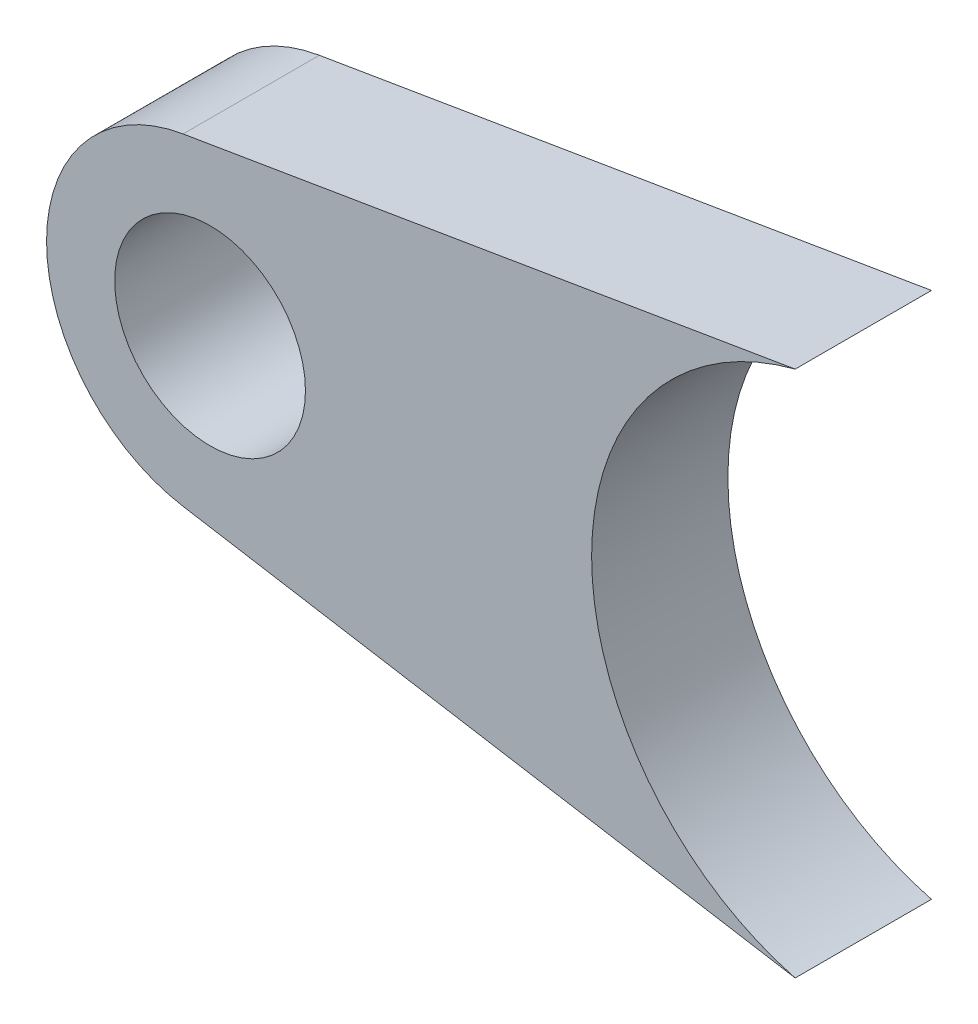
from build123d import *

# Parameters (mm, degrees)
SKETCH_1_R      = 17.5
EXTRUDE_1_DEPTH = 25


with BuildPart() as part:
    # Sketch 1 → Extrude 1 (new body)
    with BuildSketch(Plane.XY):
        with BuildLine():
            Line((-12.6530783, 48.37250882), (-124.949285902, 29.58892646))
            ThreePointArc((-124.949285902, 29.58892646), (-150, 0), (-124.949285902, -29.58892646))
            Line((-124.949285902, -29.58892646), (-12.6530783, -48.37250882))
            ThreePointArc((-12.6530783, -48.37250882), (-50, 0), (-12.6530783, 48.37250882))
        make_face()
        with Locations((-120, 0)):
            Circle(SKETCH_1_R, mode=Mode.SUBTRACT)
    extrude(amount=EXTRUDE_1_DEPTH)


solid = part.part
